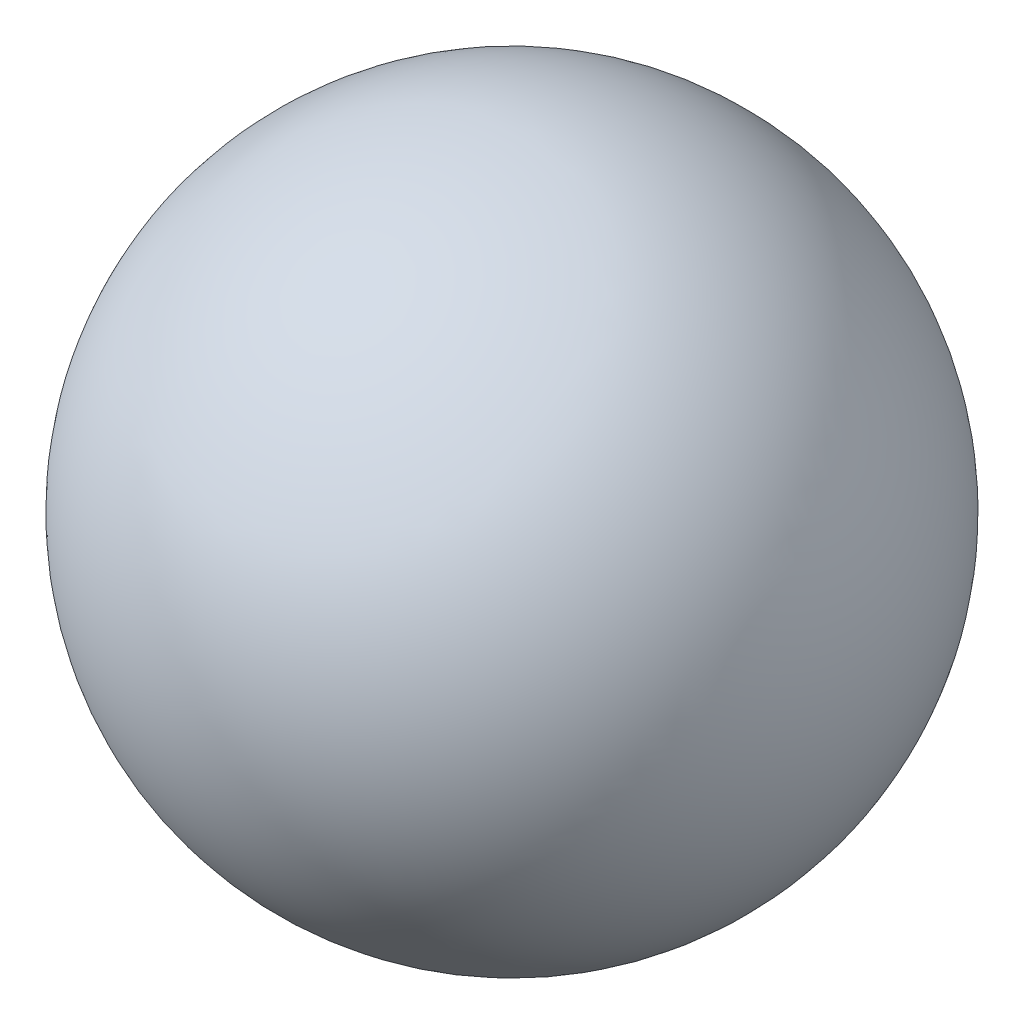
ISO-10303-21;
HEADER;
FILE_DESCRIPTION(('STEP AP214'),'2;1');
FILE_NAME('part.step','',(''),(''),'','','');
FILE_SCHEMA(('AUTOMOTIVE_DESIGN { 1 0 10303 214 1 1 1 1 }'));
ENDSEC;
DATA;
#1=APPLICATION_CONTEXT('core data for automotive mechanical design processes');
#2=APPLICATION_PROTOCOL_DEFINITION('international standard','automotive_design',2000,#1);
#3=PRODUCT_CONTEXT('',#1,'mechanical');
#4=PRODUCT('Part','Part','',(#3));
#5=PRODUCT_RELATED_PRODUCT_CATEGORY('part','',(#4));
#6=PRODUCT_DEFINITION_FORMATION('','',#4);
#7=PRODUCT_DEFINITION_CONTEXT('part definition',#1,'design');
#8=PRODUCT_DEFINITION('design','',#6,#7);
#9=PRODUCT_DEFINITION_SHAPE('','',#8);
#10=(LENGTH_UNIT() NAMED_UNIT(*) SI_UNIT(.MILLI.,.METRE.));
#11=(NAMED_UNIT(*) PLANE_ANGLE_UNIT() SI_UNIT($,.RADIAN.));
#12=(NAMED_UNIT(*) SI_UNIT($,.STERADIAN.) SOLID_ANGLE_UNIT());
#13=UNCERTAINTY_MEASURE_WITH_UNIT(LENGTH_MEASURE(1.E-05),#10,'distance_accuracy_value','');
#14=(GEOMETRIC_REPRESENTATION_CONTEXT(3) GLOBAL_UNCERTAINTY_ASSIGNED_CONTEXT((#13)) GLOBAL_UNIT_ASSIGNED_CONTEXT((#10,
#11,#12)) REPRESENTATION_CONTEXT('',''));
#15=CARTESIAN_POINT('',(0.,0.,0.));
#16=DIRECTION('',(0.,0.,1.));
#17=DIRECTION('',(1.,0.,0.));
#18=AXIS2_PLACEMENT_3D('',#15,#16,#17);
#19=CARTESIAN_POINT('',(0.,0.,0.));
#20=DIRECTION('',(-1.,0.,0.));
#21=DIRECTION('',(0.,1.,0.));
#22=AXIS2_PLACEMENT_3D('',#19,#20,#21);
#23=SPHERICAL_SURFACE('',#22,3.55);
#24=CARTESIAN_POINT('',(-3.55,0.,0.));
#25=VERTEX_POINT('',#24);
#26=VERTEX_LOOP('',#25);
#27=FACE_BOUND('',#26,.T.);
#28=ADVANCED_FACE('F28',(#27),#23,.T.);
#29=CLOSED_SHELL('',(#28));
#30=MANIFOLD_SOLID_BREP('B2',#29);
#31=ADVANCED_BREP_SHAPE_REPRESENTATION('',(#18,#30),#14);
#32=SHAPE_DEFINITION_REPRESENTATION(#9,#31);
ENDSEC;
END-ISO-10303-21;
